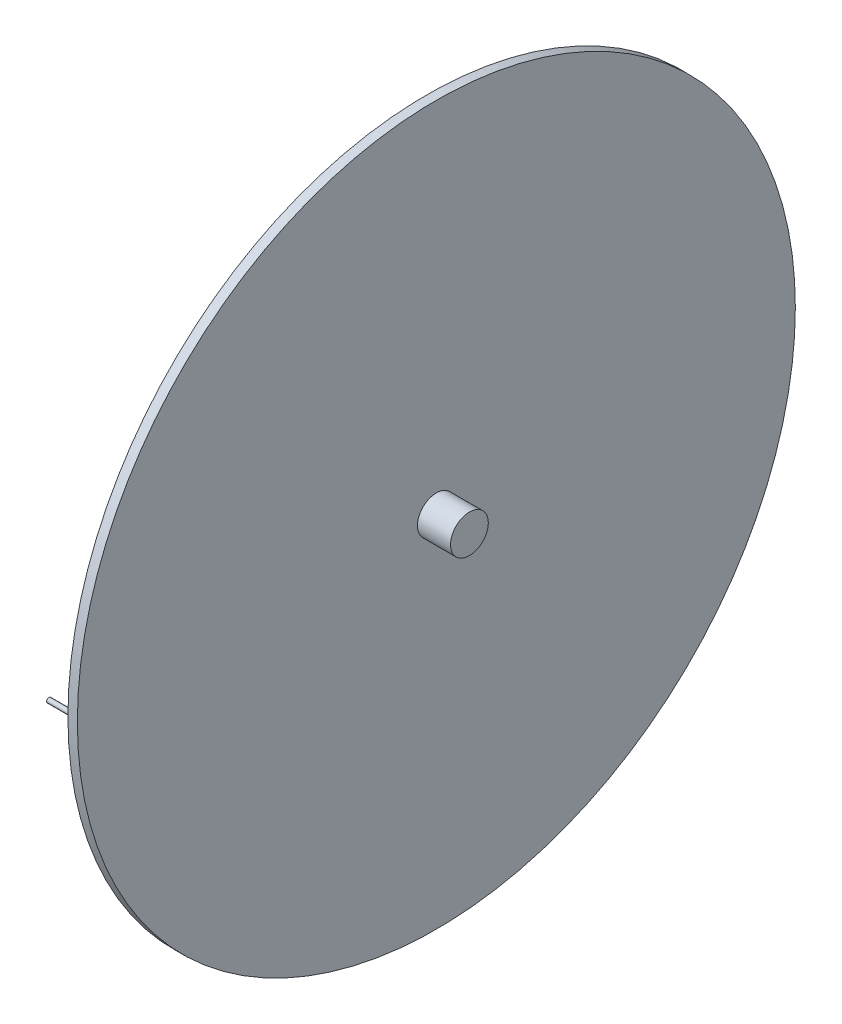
ISO-10303-21;
HEADER;
FILE_DESCRIPTION(('STEP AP214'),'2;1');
FILE_NAME('part.step','',(''),(''),'','','');
FILE_SCHEMA(('AUTOMOTIVE_DESIGN { 1 0 10303 214 1 1 1 1 }'));
ENDSEC;
DATA;
#1=APPLICATION_CONTEXT('core data for automotive mechanical design processes');
#2=APPLICATION_PROTOCOL_DEFINITION('international standard','automotive_design',2000,#1);
#3=PRODUCT_CONTEXT('',#1,'mechanical');
#4=PRODUCT('Part','Part','',(#3));
#5=PRODUCT_RELATED_PRODUCT_CATEGORY('part','',(#4));
#6=PRODUCT_DEFINITION_FORMATION('','',#4);
#7=PRODUCT_DEFINITION_CONTEXT('part definition',#1,'design');
#8=PRODUCT_DEFINITION('design','',#6,#7);
#9=PRODUCT_DEFINITION_SHAPE('','',#8);
#10=(LENGTH_UNIT() NAMED_UNIT(*) SI_UNIT(.MILLI.,.METRE.));
#11=(NAMED_UNIT(*) PLANE_ANGLE_UNIT() SI_UNIT($,.RADIAN.));
#12=(NAMED_UNIT(*) SI_UNIT($,.STERADIAN.) SOLID_ANGLE_UNIT());
#13=UNCERTAINTY_MEASURE_WITH_UNIT(LENGTH_MEASURE(1.E-05),#10,'distance_accuracy_value','');
#14=(GEOMETRIC_REPRESENTATION_CONTEXT(3) GLOBAL_UNCERTAINTY_ASSIGNED_CONTEXT((#13)) GLOBAL_UNIT_ASSIGNED_CONTEXT((#10,
#11,#12)) REPRESENTATION_CONTEXT('',''));
#15=CARTESIAN_POINT('',(0.,0.,0.));
#16=DIRECTION('',(0.,0.,1.));
#17=DIRECTION('',(1.,0.,0.));
#18=AXIS2_PLACEMENT_3D('',#15,#16,#17);
#19=CARTESIAN_POINT('',(0.,0.,0.));
#20=DIRECTION('',(1.,0.,0.));
#21=DIRECTION('',(0.,0.,-1.));
#22=AXIS2_PLACEMENT_3D('',#19,#20,#21);
#23=PLANE('',#22);
#24=CARTESIAN_POINT('',(0.,0.,0.));
#25=DIRECTION('',(1.,0.,0.));
#26=DIRECTION('',(0.,0.,-1.));
#27=AXIS2_PLACEMENT_3D('',#24,#25,#26);
#28=CIRCLE('',#27,380.);
#29=CARTESIAN_POINT('',(0.,0.,-380.));
#30=VERTEX_POINT('',#29);
#31=EDGE_CURVE('E45',#30,#30,#28,.T.);
#32=ORIENTED_EDGE('',*,*,#31,.F.);
#33=EDGE_LOOP('',(#32));
#34=FACE_BOUND('',#33,.T.);
#35=CARTESIAN_POINT('',(0.,0.,375.));
#36=DIRECTION('',(1.,0.,0.));
#37=DIRECTION('',(0.,0.,-1.));
#38=AXIS2_PLACEMENT_3D('',#35,#36,#37);
#39=CIRCLE('',#38,2.50000000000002);
#40=CARTESIAN_POINT('',(0.,0.,372.5));
#41=VERTEX_POINT('',#40);
#42=EDGE_CURVE('E10',#41,#41,#39,.F.);
#43=ORIENTED_EDGE('',*,*,#42,.F.);
#44=EDGE_LOOP('',(#43));
#45=FACE_BOUND('',#44,.T.);
#46=ADVANCED_FACE('F34',(#34,#45),#23,.F.);
#47=CARTESIAN_POINT('',(10.,0.,0.));
#48=DIRECTION('',(1.,0.,0.));
#49=DIRECTION('',(0.,0.,-1.));
#50=AXIS2_PLACEMENT_3D('',#47,#48,#49);
#51=PLANE('',#50);
#52=CARTESIAN_POINT('',(10.,0.,0.));
#53=DIRECTION('',(1.,0.,0.));
#54=DIRECTION('',(0.,0.,-1.));
#55=AXIS2_PLACEMENT_3D('',#52,#53,#54);
#56=CIRCLE('',#55,380.);
#57=CARTESIAN_POINT('',(10.,0.,-380.));
#58=VERTEX_POINT('',#57);
#59=EDGE_CURVE('E41',#58,#58,#56,.T.);
#60=ORIENTED_EDGE('',*,*,#59,.T.);
#61=EDGE_LOOP('',(#60));
#62=FACE_BOUND('',#61,.T.);
#63=CARTESIAN_POINT('',(10.,0.,0.));
#64=DIRECTION('',(1.,0.,0.));
#65=DIRECTION('',(0.,0.,-1.));
#66=AXIS2_PLACEMENT_3D('',#63,#64,#65);
#67=CIRCLE('',#66,20.);
#68=CARTESIAN_POINT('',(10.,0.,-20.));
#69=VERTEX_POINT('',#68);
#70=EDGE_CURVE('E52',#69,#69,#67,.T.);
#71=ORIENTED_EDGE('',*,*,#70,.F.);
#72=EDGE_LOOP('',(#71));
#73=FACE_BOUND('',#72,.T.);
#74=ADVANCED_FACE('F76',(#62,#73),#51,.T.);
#75=CARTESIAN_POINT('',(10.,0.,0.));
#76=DIRECTION('',(-1.,0.,0.));
#77=DIRECTION('',(0.,0.,1.));
#78=AXIS2_PLACEMENT_3D('',#75,#76,#77);
#79=CYLINDRICAL_SURFACE('',#78,380.);
#80=ORIENTED_EDGE('',*,*,#59,.F.);
#81=EDGE_LOOP('',(#80));
#82=FACE_BOUND('',#81,.T.);
#83=ORIENTED_EDGE('',*,*,#31,.T.);
#84=EDGE_LOOP('',(#83));
#85=FACE_BOUND('',#84,.T.);
#86=ADVANCED_FACE('F36',(#82,#85),#79,.T.);
#87=CARTESIAN_POINT('',(45.,0.,0.));
#88=DIRECTION('',(-1.,0.,0.));
#89=DIRECTION('',(0.,0.,1.));
#90=AXIS2_PLACEMENT_3D('',#87,#88,#89);
#91=CYLINDRICAL_SURFACE('',#90,20.);
#92=CARTESIAN_POINT('',(45.,0.,0.));
#93=DIRECTION('',(1.,0.,0.));
#94=DIRECTION('',(0.,0.,-1.));
#95=AXIS2_PLACEMENT_3D('',#92,#93,#94);
#96=CIRCLE('',#95,20.);
#97=CARTESIAN_POINT('',(45.,0.,-20.));
#98=VERTEX_POINT('',#97);
#99=EDGE_CURVE('E50',#98,#98,#96,.T.);
#100=ORIENTED_EDGE('',*,*,#99,.F.);
#101=EDGE_LOOP('',(#100));
#102=FACE_BOUND('',#101,.T.);
#103=ORIENTED_EDGE('',*,*,#70,.T.);
#104=EDGE_LOOP('',(#103));
#105=FACE_BOUND('',#104,.T.);
#106=ADVANCED_FACE('F72',(#102,#105),#91,.T.);
#107=CARTESIAN_POINT('',(45.,0.,0.));
#108=DIRECTION('',(1.,0.,0.));
#109=DIRECTION('',(0.,0.,-1.));
#110=AXIS2_PLACEMENT_3D('',#107,#108,#109);
#111=PLANE('',#110);
#112=ORIENTED_EDGE('',*,*,#99,.T.);
#113=EDGE_LOOP('',(#112));
#114=FACE_BOUND('',#113,.T.);
#115=ADVANCED_FACE('F65',(#114),#111,.T.);
#116=CARTESIAN_POINT('',(-25.,0.,375.));
#117=DIRECTION('',(1.,0.,0.));
#118=DIRECTION('',(0.,0.,-1.));
#119=AXIS2_PLACEMENT_3D('',#116,#117,#118);
#120=CYLINDRICAL_SURFACE('',#119,2.50000000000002);
#121=CARTESIAN_POINT('',(-25.,0.,375.));
#122=DIRECTION('',(-1.,0.,0.));
#123=DIRECTION('',(0.,0.,1.));
#124=AXIS2_PLACEMENT_3D('',#121,#122,#123);
#125=CIRCLE('',#124,2.50000000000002);
#126=CARTESIAN_POINT('',(-25.,0.,377.5));
#127=VERTEX_POINT('',#126);
#128=EDGE_CURVE('E55',#127,#127,#125,.T.);
#129=ORIENTED_EDGE('',*,*,#128,.F.);
#130=EDGE_LOOP('',(#129));
#131=FACE_BOUND('',#130,.T.);
#132=ORIENTED_EDGE('',*,*,#42,.T.);
#133=EDGE_LOOP('',(#132));
#134=FACE_BOUND('',#133,.T.);
#135=ADVANCED_FACE('F63',(#131,#134),#120,.T.);
#136=CARTESIAN_POINT('',(-25.,0.,375.));
#137=DIRECTION('',(-1.,0.,0.));
#138=DIRECTION('',(0.,0.,1.));
#139=AXIS2_PLACEMENT_3D('',#136,#137,#138);
#140=PLANE('',#139);
#141=ORIENTED_EDGE('',*,*,#128,.T.);
#142=EDGE_LOOP('',(#141));
#143=FACE_BOUND('',#142,.T.);
#144=ADVANCED_FACE('F61',(#143),#140,.T.);
#145=CLOSED_SHELL('',(#46,#74,#86,#106,#115,#135,#144));
#146=MANIFOLD_SOLID_BREP('B2',#145);
#147=ADVANCED_BREP_SHAPE_REPRESENTATION('',(#18,#146),#14);
#148=SHAPE_DEFINITION_REPRESENTATION(#9,#147);
ENDSEC;
END-ISO-10303-21;
